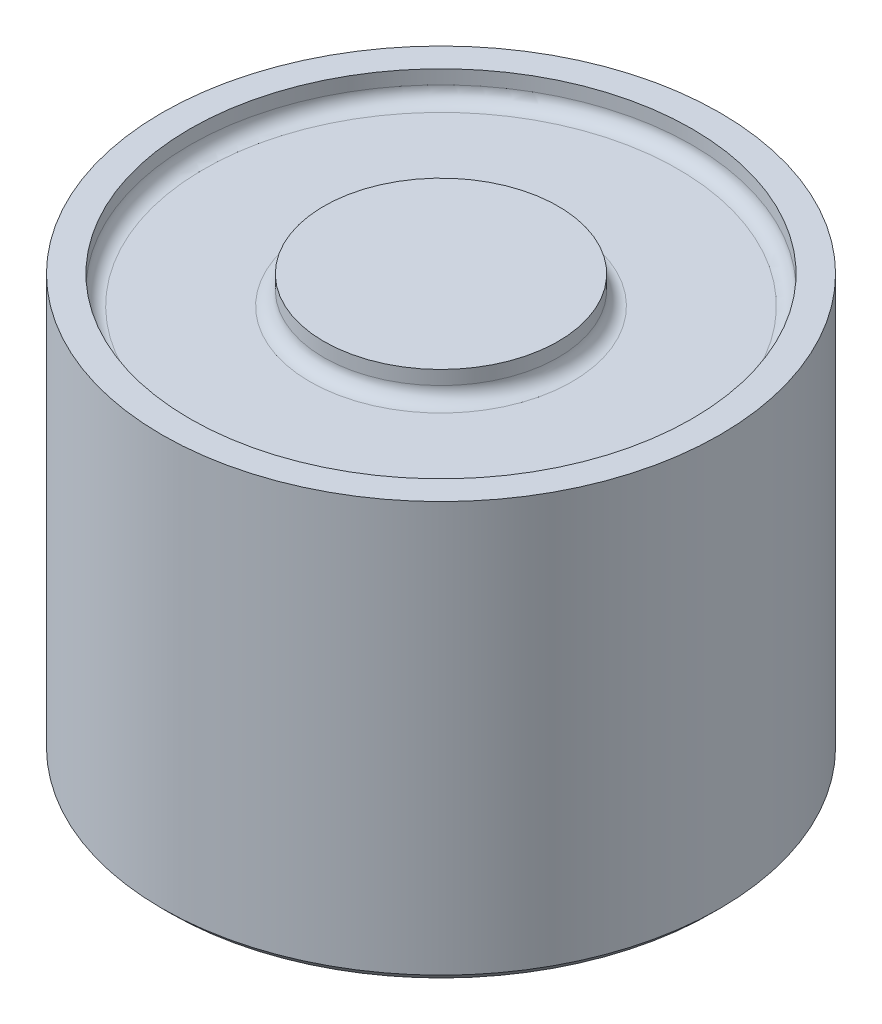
from build123d import *

# Parameters (mm, degrees)
ESQUISSE1_R             = 10
BOSS_EXTRU_1_DEPTH      = 15
ESQUISSE2_R             = 9
ESQUISSE2_R_2           = 4.2
ENL_V_MAT_EXTRU_1_DEPTH = 1
CONG_1_R                = 0.5
ESQUISSE3_R             = 1.4
ENL_V_MAT_EXTRU_2_DEPTH = 4
CHANFREIN1_SIZE         = 0.3


with BuildPart() as part:
    # Esquisse1 → Boss.-Extru.1 (new body)
    with BuildSketch(Plane(origin=(0, 0, 0), x_dir=(1, 0, 0), z_dir=(0, 1, 0))):
        with Locations(Location((0, 0, 0), (0, 0, 270))):
            Circle(ESQUISSE1_R)
    extrude(amount=BOSS_EXTRU_1_DEPTH)

    # Esquisse2 → Enl_v. mat.-Extru.1 (cut)
    with BuildSketch(Plane(origin=(0, 15, 0), x_dir=(1, 0, 0), z_dir=(0, 1, 0))):
        with Locations(Location((0, 0, 0), (0, 0, 270))):
            Circle(ESQUISSE2_R)
        with Locations(Location((0, 0, 0), (0, 0, 270))):
            Circle(ESQUISSE2_R_2, mode=Mode.SUBTRACT)
    extrude(amount=-ENL_V_MAT_EXTRU_1_DEPTH, mode=Mode.SUBTRACT)

    # Cong_1
    cong_1_edges = [part.edges().sort_by_distance(p)[0] for p in [
        (0, 14, -9),
        (0, 14, -4.2),
    ]]
    fillet(cong_1_edges, radius=CONG_1_R)

    # Esquisse3 → Enl_v. mat.-Extru.2 (cut)
    with BuildSketch(Plane.XZ):
        with Locations(Location((0, -5, 0), (0, 0, 270))):
            Circle(ESQUISSE3_R)
        with Locations(Location((-4.330127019, 2.5, 0), (0, 0, 270))):
            Circle(ESQUISSE3_R)
        with Locations(Location((4.330127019, 2.5, 0), (0, 0, 270))):
            Circle(ESQUISSE3_R)
    extrude(amount=-ENL_V_MAT_EXTRU_2_DEPTH, mode=Mode.SUBTRACT)

    # Chanfrein1
    chanfrein1_edges = [part.edges().sort_by_distance(p)[0] for p in [
        (0, 0, -10),
    ]]
    chamfer(chanfrein1_edges, length=CHANFREIN1_SIZE)


solid = part.part
